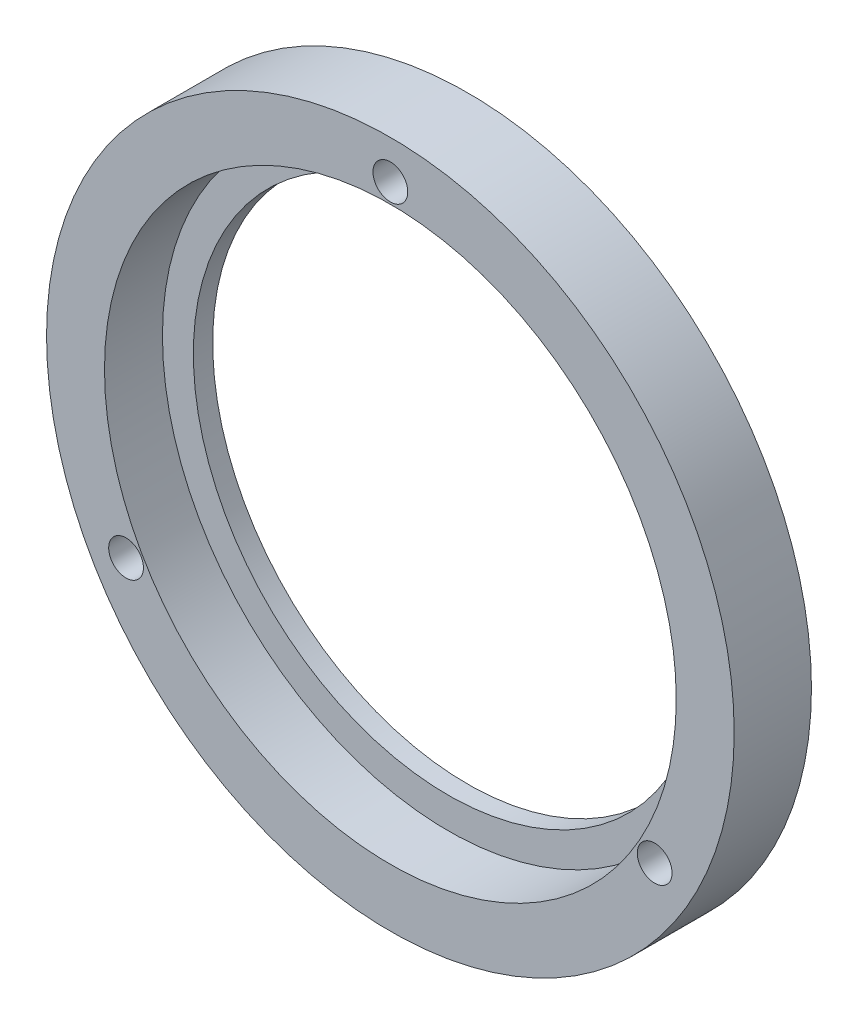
ISO-10303-21;
HEADER;
FILE_DESCRIPTION(('STEP AP214'),'2;1');
FILE_NAME('part.step','',(''),(''),'','','');
FILE_SCHEMA(('AUTOMOTIVE_DESIGN { 1 0 10303 214 1 1 1 1 }'));
ENDSEC;
DATA;
#1=APPLICATION_CONTEXT('core data for automotive mechanical design processes');
#2=APPLICATION_PROTOCOL_DEFINITION('international standard','automotive_design',2000,#1);
#3=PRODUCT_CONTEXT('',#1,'mechanical');
#4=PRODUCT('Part','Part','',(#3));
#5=PRODUCT_RELATED_PRODUCT_CATEGORY('part','',(#4));
#6=PRODUCT_DEFINITION_FORMATION('','',#4);
#7=PRODUCT_DEFINITION_CONTEXT('part definition',#1,'design');
#8=PRODUCT_DEFINITION('design','',#6,#7);
#9=PRODUCT_DEFINITION_SHAPE('','',#8);
#10=(LENGTH_UNIT() NAMED_UNIT(*) SI_UNIT(.MILLI.,.METRE.));
#11=(NAMED_UNIT(*) PLANE_ANGLE_UNIT() SI_UNIT($,.RADIAN.));
#12=(NAMED_UNIT(*) SI_UNIT($,.STERADIAN.) SOLID_ANGLE_UNIT());
#13=UNCERTAINTY_MEASURE_WITH_UNIT(LENGTH_MEASURE(1.E-05),#10,'distance_accuracy_value','');
#14=(GEOMETRIC_REPRESENTATION_CONTEXT(3) GLOBAL_UNCERTAINTY_ASSIGNED_CONTEXT((#13)) GLOBAL_UNIT_ASSIGNED_CONTEXT((#10,
#11,#12)) REPRESENTATION_CONTEXT('',''));
#15=CARTESIAN_POINT('',(0.,0.,0.));
#16=DIRECTION('',(0.,0.,1.));
#17=DIRECTION('',(1.,0.,0.));
#18=AXIS2_PLACEMENT_3D('',#15,#16,#17);
#19=CARTESIAN_POINT('',(0.,0.,30.));
#20=DIRECTION('',(0.,0.,1.));
#21=DIRECTION('',(1.,0.,0.));
#22=AXIS2_PLACEMENT_3D('',#19,#20,#21);
#23=CYLINDRICAL_SURFACE('',#22,33.);
#24=CARTESIAN_POINT('',(0.,0.,-7.5));
#25=DIRECTION('',(0.,0.,1.));
#26=DIRECTION('',(1.,0.,0.));
#27=AXIS2_PLACEMENT_3D('',#24,#25,#26);
#28=CIRCLE('',#27,33.);
#29=CARTESIAN_POINT('',(33.,0.,-7.5));
#30=VERTEX_POINT('',#29);
#31=EDGE_CURVE('E10',#30,#30,#28,.T.);
#32=ORIENTED_EDGE('',*,*,#31,.T.);
#33=EDGE_LOOP('',(#32));
#34=FACE_BOUND('',#33,.T.);
#35=CARTESIAN_POINT('',(0.,0.,-9.99999999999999));
#36=DIRECTION('',(0.,0.,1.));
#37=DIRECTION('',(1.,0.,0.));
#38=AXIS2_PLACEMENT_3D('',#35,#36,#37);
#39=CIRCLE('',#38,33.);
#40=CARTESIAN_POINT('',(33.,0.,-9.99999999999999));
#41=VERTEX_POINT('',#40);
#42=EDGE_CURVE('E49',#41,#41,#39,.T.);
#43=ORIENTED_EDGE('',*,*,#42,.F.);
#44=EDGE_LOOP('',(#43));
#45=FACE_BOUND('',#44,.T.);
#46=ADVANCED_FACE('F27',(#34,#45),#23,.F.);
#47=CARTESIAN_POINT('',(37.,0.,-7.5));
#48=DIRECTION('',(0.,0.,1.));
#49=DIRECTION('',(1.,0.,0.));
#50=AXIS2_PLACEMENT_3D('',#47,#48,#49);
#51=PLANE('',#50);
#52=CARTESIAN_POINT('',(0.,0.,-7.5));
#53=DIRECTION('',(0.,0.,1.));
#54=DIRECTION('',(1.,0.,0.));
#55=AXIS2_PLACEMENT_3D('',#52,#53,#54);
#56=CIRCLE('',#55,37.);
#57=CARTESIAN_POINT('',(37.,0.,-7.5));
#58=VERTEX_POINT('',#57);
#59=EDGE_CURVE('E33',#58,#58,#56,.T.);
#60=ORIENTED_EDGE('',*,*,#59,.T.);
#61=EDGE_LOOP('',(#60));
#62=FACE_BOUND('',#61,.T.);
#63=ORIENTED_EDGE('',*,*,#31,.F.);
#64=EDGE_LOOP('',(#63));
#65=FACE_BOUND('',#64,.T.);
#66=ADVANCED_FACE('F89',(#62,#65),#51,.T.);
#67=CARTESIAN_POINT('',(0.,0.,30.));
#68=DIRECTION('',(0.,0.,1.));
#69=DIRECTION('',(1.,0.,0.));
#70=AXIS2_PLACEMENT_3D('',#67,#68,#69);
#71=CYLINDRICAL_SURFACE('',#70,37.);
#72=CARTESIAN_POINT('',(0.,0.,0.));
#73=DIRECTION('',(0.,0.,1.));
#74=DIRECTION('',(1.,0.,0.));
#75=AXIS2_PLACEMENT_3D('',#72,#73,#74);
#76=CIRCLE('',#75,37.);
#77=CARTESIAN_POINT('',(37.,0.,0.));
#78=VERTEX_POINT('',#77);
#79=EDGE_CURVE('E37',#78,#78,#76,.T.);
#80=ORIENTED_EDGE('',*,*,#79,.T.);
#81=EDGE_LOOP('',(#80));
#82=FACE_BOUND('',#81,.T.);
#83=ORIENTED_EDGE('',*,*,#59,.F.);
#84=EDGE_LOOP('',(#83));
#85=FACE_BOUND('',#84,.T.);
#86=ADVANCED_FACE('F77',(#82,#85),#71,.F.);
#87=CARTESIAN_POINT('',(44.5,0.,0.));
#88=DIRECTION('',(0.,0.,1.));
#89=DIRECTION('',(1.,0.,0.));
#90=AXIS2_PLACEMENT_3D('',#87,#88,#89);
#91=PLANE('',#90);
#92=CARTESIAN_POINT('',(-34.2080034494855,-19.7499999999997,0.));
#93=DIRECTION('',(0.,0.,1.));
#94=DIRECTION('',(-0.499999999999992,0.866025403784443,0.));
#95=AXIS2_PLACEMENT_3D('',#92,#93,#94);
#96=CIRCLE('',#95,2.25);
#97=CARTESIAN_POINT('',(-35.3330034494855,-17.8014428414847,0.));
#98=VERTEX_POINT('',#97);
#99=EDGE_CURVE('E67',#98,#98,#96,.T.);
#100=ORIENTED_EDGE('',*,*,#99,.F.);
#101=EDGE_LOOP('',(#100));
#102=FACE_BOUND('',#101,.T.);
#103=CARTESIAN_POINT('',(34.2080034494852,-19.7500000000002,0.));
#104=DIRECTION('',(0.,0.,1.));
#105=DIRECTION('',(-0.500000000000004,-0.866025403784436,0.));
#106=AXIS2_PLACEMENT_3D('',#103,#104,#105);
#107=CIRCLE('',#106,2.25);
#108=CARTESIAN_POINT('',(33.0830034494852,-21.6985571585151,0.));
#109=VERTEX_POINT('',#108);
#110=EDGE_CURVE('E61',#109,#109,#107,.T.);
#111=ORIENTED_EDGE('',*,*,#110,.F.);
#112=EDGE_LOOP('',(#111));
#113=FACE_BOUND('',#112,.T.);
#114=CARTESIAN_POINT('',(0.,39.5,0.));
#115=DIRECTION('',(0.,0.,1.));
#116=DIRECTION('',(1.,0.,0.));
#117=AXIS2_PLACEMENT_3D('',#114,#115,#116);
#118=CIRCLE('',#117,2.25);
#119=CARTESIAN_POINT('',(2.25,39.5,0.));
#120=VERTEX_POINT('',#119);
#121=EDGE_CURVE('E55',#120,#120,#118,.T.);
#122=ORIENTED_EDGE('',*,*,#121,.F.);
#123=EDGE_LOOP('',(#122));
#124=FACE_BOUND('',#123,.T.);
#125=CARTESIAN_POINT('',(0.,0.,0.));
#126=DIRECTION('',(0.,0.,1.));
#127=DIRECTION('',(1.,0.,0.));
#128=AXIS2_PLACEMENT_3D('',#125,#126,#127);
#129=CIRCLE('',#128,44.5);
#130=CARTESIAN_POINT('',(44.5,0.,0.));
#131=VERTEX_POINT('',#130);
#132=EDGE_CURVE('E41',#131,#131,#129,.T.);
#133=ORIENTED_EDGE('',*,*,#132,.T.);
#134=EDGE_LOOP('',(#133));
#135=FACE_BOUND('',#134,.T.);
#136=ORIENTED_EDGE('',*,*,#79,.F.);
#137=EDGE_LOOP('',(#136));
#138=FACE_BOUND('',#137,.T.);
#139=ADVANCED_FACE('F73',(#102,#113,#124,#135,#138),#91,.T.);
#140=CARTESIAN_POINT('',(0.,0.,30.));
#141=DIRECTION('',(0.,0.,1.));
#142=DIRECTION('',(1.,0.,0.));
#143=AXIS2_PLACEMENT_3D('',#140,#141,#142);
#144=CYLINDRICAL_SURFACE('',#143,44.5);
#145=CARTESIAN_POINT('',(0.,0.,-10.));
#146=DIRECTION('',(0.,0.,1.));
#147=DIRECTION('',(1.,0.,0.));
#148=AXIS2_PLACEMENT_3D('',#145,#146,#147);
#149=CIRCLE('',#148,44.5);
#150=CARTESIAN_POINT('',(44.5,0.,-10.));
#151=VERTEX_POINT('',#150);
#152=EDGE_CURVE('E46',#151,#151,#149,.T.);
#153=ORIENTED_EDGE('',*,*,#152,.T.);
#154=EDGE_LOOP('',(#153));
#155=FACE_BOUND('',#154,.T.);
#156=ORIENTED_EDGE('',*,*,#132,.F.);
#157=EDGE_LOOP('',(#156));
#158=FACE_BOUND('',#157,.T.);
#159=ADVANCED_FACE('F76',(#155,#158),#144,.T.);
#160=CARTESIAN_POINT('',(33.,0.,-10.));
#161=DIRECTION('',(0.,0.,-1.));
#162=DIRECTION('',(-1.,0.,0.));
#163=AXIS2_PLACEMENT_3D('',#160,#161,#162);
#164=PLANE('',#163);
#165=CARTESIAN_POINT('',(-34.2080034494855,-19.7499999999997,-10.));
#166=DIRECTION('',(0.,0.,1.));
#167=DIRECTION('',(-0.499999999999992,0.866025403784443,0.));
#168=AXIS2_PLACEMENT_3D('',#165,#166,#167);
#169=CIRCLE('',#168,2.25);
#170=CARTESIAN_POINT('',(-35.3330034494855,-17.8014428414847,-10.));
#171=VERTEX_POINT('',#170);
#172=EDGE_CURVE('E64',#171,#171,#169,.T.);
#173=ORIENTED_EDGE('',*,*,#172,.T.);
#174=EDGE_LOOP('',(#173));
#175=FACE_BOUND('',#174,.T.);
#176=CARTESIAN_POINT('',(34.2080034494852,-19.7500000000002,-10.));
#177=DIRECTION('',(0.,0.,1.));
#178=DIRECTION('',(-0.500000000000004,-0.866025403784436,0.));
#179=AXIS2_PLACEMENT_3D('',#176,#177,#178);
#180=CIRCLE('',#179,2.25);
#181=CARTESIAN_POINT('',(33.0830034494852,-21.6985571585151,-10.));
#182=VERTEX_POINT('',#181);
#183=EDGE_CURVE('E58',#182,#182,#180,.T.);
#184=ORIENTED_EDGE('',*,*,#183,.T.);
#185=EDGE_LOOP('',(#184));
#186=FACE_BOUND('',#185,.T.);
#187=CARTESIAN_POINT('',(0.,39.5,-10.));
#188=DIRECTION('',(0.,0.,1.));
#189=DIRECTION('',(1.,0.,0.));
#190=AXIS2_PLACEMENT_3D('',#187,#188,#189);
#191=CIRCLE('',#190,2.25);
#192=CARTESIAN_POINT('',(2.25,39.5,-10.));
#193=VERTEX_POINT('',#192);
#194=EDGE_CURVE('E52',#193,#193,#191,.T.);
#195=ORIENTED_EDGE('',*,*,#194,.T.);
#196=EDGE_LOOP('',(#195));
#197=FACE_BOUND('',#196,.T.);
#198=ORIENTED_EDGE('',*,*,#42,.T.);
#199=EDGE_LOOP('',(#198));
#200=FACE_BOUND('',#199,.T.);
#201=ORIENTED_EDGE('',*,*,#152,.F.);
#202=EDGE_LOOP('',(#201));
#203=FACE_BOUND('',#202,.T.);
#204=ADVANCED_FACE('F100',(#175,#186,#197,#200,#203),#164,.T.);
#205=CARTESIAN_POINT('',(0.,39.5,-10.));
#206=DIRECTION('',(0.,0.,1.));
#207=DIRECTION('',(1.,0.,0.));
#208=AXIS2_PLACEMENT_3D('',#205,#206,#207);
#209=CYLINDRICAL_SURFACE('',#208,2.25);
#210=ORIENTED_EDGE('',*,*,#194,.F.);
#211=EDGE_LOOP('',(#210));
#212=FACE_BOUND('',#211,.T.);
#213=ORIENTED_EDGE('',*,*,#121,.T.);
#214=EDGE_LOOP('',(#213));
#215=FACE_BOUND('',#214,.T.);
#216=ADVANCED_FACE('F103',(#212,#215),#209,.F.);
#217=CARTESIAN_POINT('',(34.2080034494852,-19.7500000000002,-10.));
#218=DIRECTION('',(0.,0.,1.));
#219=DIRECTION('',(1.,0.,0.));
#220=AXIS2_PLACEMENT_3D('',#217,#218,#219);
#221=CYLINDRICAL_SURFACE('',#220,2.25);
#222=ORIENTED_EDGE('',*,*,#183,.F.);
#223=EDGE_LOOP('',(#222));
#224=FACE_BOUND('',#223,.T.);
#225=ORIENTED_EDGE('',*,*,#110,.T.);
#226=EDGE_LOOP('',(#225));
#227=FACE_BOUND('',#226,.T.);
#228=ADVANCED_FACE('F116',(#224,#227),#221,.F.);
#229=CARTESIAN_POINT('',(-34.2080034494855,-19.7499999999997,-10.));
#230=DIRECTION('',(0.,0.,1.));
#231=DIRECTION('',(1.,0.,0.));
#232=AXIS2_PLACEMENT_3D('',#229,#230,#231);
#233=CYLINDRICAL_SURFACE('',#232,2.25);
#234=ORIENTED_EDGE('',*,*,#172,.F.);
#235=EDGE_LOOP('',(#234));
#236=FACE_BOUND('',#235,.T.);
#237=ORIENTED_EDGE('',*,*,#99,.T.);
#238=EDGE_LOOP('',(#237));
#239=FACE_BOUND('',#238,.T.);
#240=ADVANCED_FACE('F71',(#236,#239),#233,.F.);
#241=CLOSED_SHELL('',(#46,#66,#86,#139,#159,#204,#216,#228,#240));
#242=MANIFOLD_SOLID_BREP('B2',#241);
#243=ADVANCED_BREP_SHAPE_REPRESENTATION('',(#18,#242),#14);
#244=SHAPE_DEFINITION_REPRESENTATION(#9,#243);
ENDSEC;
END-ISO-10303-21;
